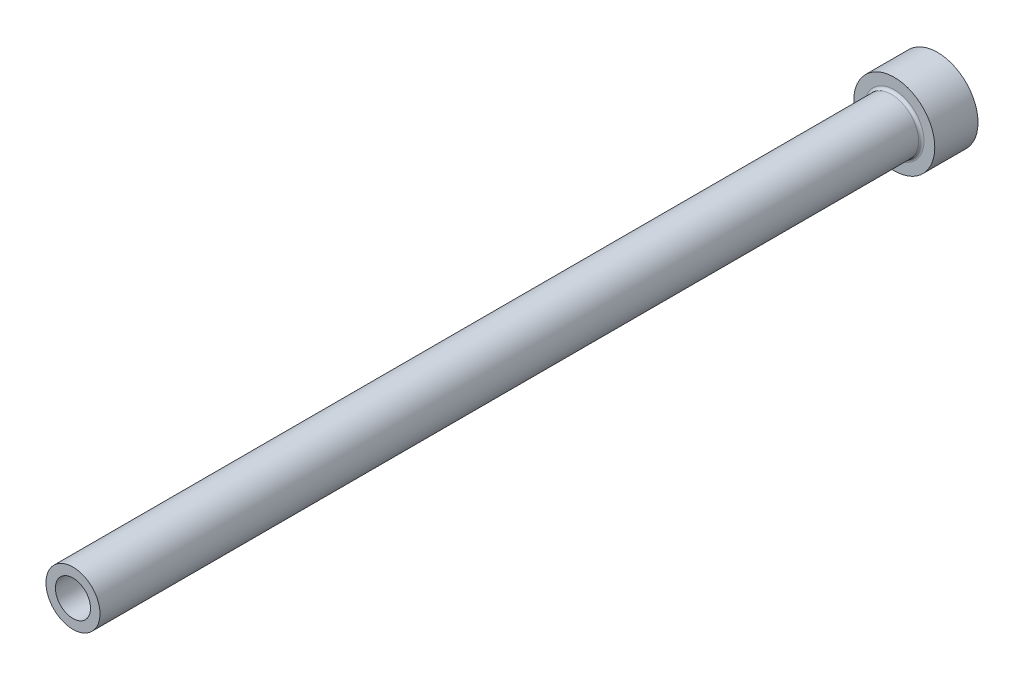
from build123d import *

# Parameters (mm, degrees)
HEAD_FILLET_R          = 0.5
ID_RELIEF_CHAMFER_SIZE = 0.5


with BuildPart() as part:
    # OD FV → Base Revolve (revolve)
    with BuildSketch(Plane(origin=(0, 0, 0), x_dir=(1, 0, 0), z_dir=(0, 1, 0))):
        Polygon((0, -160), (5, -160), (5, -8), (7.5, -8), (7.5, 0), (0, 0), align=None)
    revolve(axis=Axis((0, 0, 160), (0, 0, -1)))

    # ID FV → Hole (revolve, cut)
    with BuildSketch(Plane(origin=(0, 0, 0), x_dir=(1, 0, 0), z_dir=(0, 1, 0))):
        Polygon((0, -160), (3.25, -160), (3.25, -85), (3.5, -84.566987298), (3.5, 0), (0, 0), align=None)
    revolve(axis=Axis((0, 0, 160), (0, 0, -1)), mode=Mode.SUBTRACT)

    # Head Fillet
    head_fillet_edges = [part.edges().sort_by_distance(p)[0] for p in [
        (-5, 0, 8),
    ]]
    fillet(head_fillet_edges, radius=HEAD_FILLET_R)

    # ID Relief Chamfer
    id_relief_chamfer_edges = [part.edges().sort_by_distance(p)[0] for p in [
        (-3.5, 0, 0),
    ]]
    chamfer(id_relief_chamfer_edges, length=ID_RELIEF_CHAMFER_SIZE)


solid = part.part
